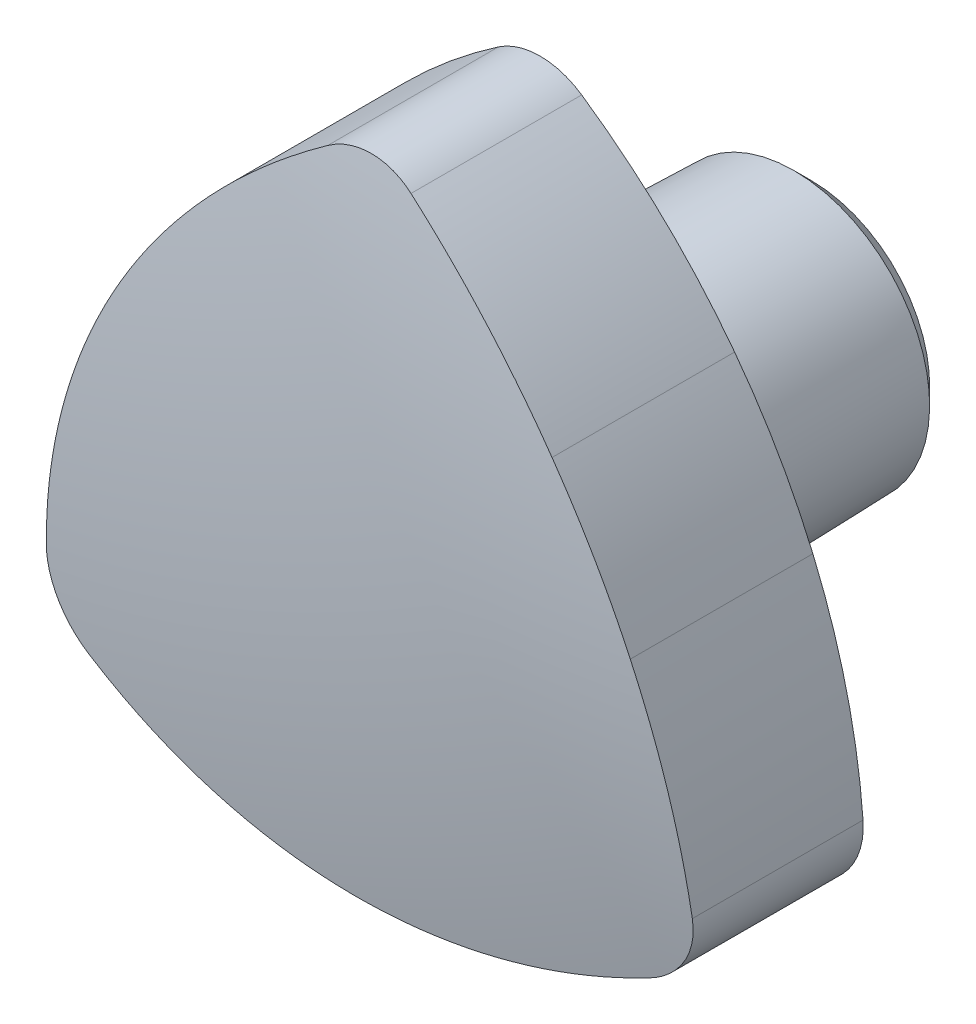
ISO-10303-21;
HEADER;
FILE_DESCRIPTION(('STEP AP214'),'2;1');
FILE_NAME('part.step','',(''),(''),'','','');
FILE_SCHEMA(('AUTOMOTIVE_DESIGN { 1 0 10303 214 1 1 1 1 }'));
ENDSEC;
DATA;
#1=APPLICATION_CONTEXT('core data for automotive mechanical design processes');
#2=APPLICATION_PROTOCOL_DEFINITION('international standard','automotive_design',2000,#1);
#3=PRODUCT_CONTEXT('',#1,'mechanical');
#4=PRODUCT('Part','Part','',(#3));
#5=PRODUCT_RELATED_PRODUCT_CATEGORY('part','',(#4));
#6=PRODUCT_DEFINITION_FORMATION('','',#4);
#7=PRODUCT_DEFINITION_CONTEXT('part definition',#1,'design');
#8=PRODUCT_DEFINITION('design','',#6,#7);
#9=PRODUCT_DEFINITION_SHAPE('','',#8);
#10=(LENGTH_UNIT() NAMED_UNIT(*) SI_UNIT(.MILLI.,.METRE.));
#11=(NAMED_UNIT(*) PLANE_ANGLE_UNIT() SI_UNIT($,.RADIAN.));
#12=(NAMED_UNIT(*) SI_UNIT($,.STERADIAN.) SOLID_ANGLE_UNIT());
#13=UNCERTAINTY_MEASURE_WITH_UNIT(LENGTH_MEASURE(1.E-05),#10,'distance_accuracy_value','');
#14=(GEOMETRIC_REPRESENTATION_CONTEXT(3) GLOBAL_UNCERTAINTY_ASSIGNED_CONTEXT((#13)) GLOBAL_UNIT_ASSIGNED_CONTEXT((#10,
#11,#12)) REPRESENTATION_CONTEXT('',''));
#15=CARTESIAN_POINT('',(0.,0.,0.));
#16=DIRECTION('',(0.,0.,1.));
#17=DIRECTION('',(1.,0.,0.));
#18=AXIS2_PLACEMENT_3D('',#15,#16,#17);
#19=CARTESIAN_POINT('',(0.,0.,10.0000000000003));
#20=DIRECTION('',(0.,0.,-1.));
#21=DIRECTION('',(0.,1.,0.));
#22=AXIS2_PLACEMENT_3D('',#19,#20,#21);
#23=PLANE('',#22);
#24=CARTESIAN_POINT('',(0.,0.,10.0000000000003));
#25=DIRECTION('',(0.,0.,-1.));
#26=DIRECTION('',(0.,1.,0.));
#27=AXIS2_PLACEMENT_3D('',#24,#25,#26);
#28=CIRCLE('',#27,2.49999999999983);
#29=CARTESIAN_POINT('',(0.,2.49999999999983,10.0000000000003));
#30=VERTEX_POINT('',#29);
#31=EDGE_CURVE('E110',#30,#30,#28,.T.);
#32=ORIENTED_EDGE('',*,*,#31,.T.);
#33=EDGE_LOOP('',(#32));
#34=FACE_BOUND('',#33,.T.);
#35=ADVANCED_FACE('F14',(#34),#23,.T.);
#36=CARTESIAN_POINT('',(0.,0.,-5.));
#37=DIRECTION('',(0.,0.,-1.));
#38=DIRECTION('',(0.,1.,0.));
#39=AXIS2_PLACEMENT_3D('',#36,#37,#38);
#40=CYLINDRICAL_SURFACE('',#39,2.49999999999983);
#41=CARTESIAN_POINT('',(0.,0.,0.));
#42=DIRECTION('',(0.,0.,-1.));
#43=DIRECTION('',(0.,1.,0.));
#44=AXIS2_PLACEMENT_3D('',#41,#42,#43);
#45=CIRCLE('',#44,2.49999999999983);
#46=CARTESIAN_POINT('',(0.,2.49999999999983,0.));
#47=VERTEX_POINT('',#46);
#48=EDGE_CURVE('E258',#47,#47,#45,.T.);
#49=ORIENTED_EDGE('',*,*,#48,.T.);
#50=EDGE_LOOP('',(#49));
#51=FACE_BOUND('',#50,.T.);
#52=ORIENTED_EDGE('',*,*,#31,.F.);
#53=EDGE_LOOP('',(#52));
#54=FACE_BOUND('',#53,.T.);
#55=ADVANCED_FACE('F247',(#51,#54),#40,.F.);
#56=CARTESIAN_POINT('',(5.22983245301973,0.,0.));
#57=DIRECTION('',(0.,0.,-1.));
#58=DIRECTION('',(0.,1.,0.));
#59=AXIS2_PLACEMENT_3D('',#56,#57,#58);
#60=PLANE('',#59);
#61=CARTESIAN_POINT('',(0.,0.,0.));
#62=DIRECTION('',(0.,0.,-1.));
#63=DIRECTION('',(0.,1.,0.));
#64=AXIS2_PLACEMENT_3D('',#61,#62,#63);
#65=CIRCLE('',#64,5.22983245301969);
#66=CARTESIAN_POINT('',(0.,5.22983245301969,0.));
#67=VERTEX_POINT('',#66);
#68=EDGE_CURVE('E260',#67,#67,#65,.T.);
#69=ORIENTED_EDGE('',*,*,#68,.T.);
#70=EDGE_LOOP('',(#69));
#71=FACE_BOUND('',#70,.T.);
#72=ORIENTED_EDGE('',*,*,#48,.F.);
#73=EDGE_LOOP('',(#72));
#74=FACE_BOUND('',#73,.T.);
#75=ADVANCED_FACE('F253',(#71,#74),#60,.T.);
#76=CARTESIAN_POINT('',(0.,0.,0.));
#77=DIRECTION('',(0.,0.,1.));
#78=DIRECTION('',(0.,-1.,0.));
#79=AXIS2_PLACEMENT_3D('',#76,#77,#78);
#80=CONICAL_SURFACE('',#79,5.22983245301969,0.785398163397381);
#81=CARTESIAN_POINT('',(0.,0.,0.770167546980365));
#82=DIRECTION('',(0.,0.,-1.));
#83=DIRECTION('',(0.,1.,0.));
#84=AXIS2_PLACEMENT_3D('',#81,#82,#83);
#85=CIRCLE('',#84,6.);
#86=CARTESIAN_POINT('',(0.,6.,0.770167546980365));
#87=VERTEX_POINT('',#86);
#88=EDGE_CURVE('E265',#87,#87,#85,.T.);
#89=ORIENTED_EDGE('',*,*,#88,.T.);
#90=EDGE_LOOP('',(#89));
#91=FACE_BOUND('',#90,.T.);
#92=ORIENTED_EDGE('',*,*,#68,.F.);
#93=EDGE_LOOP('',(#92));
#94=FACE_BOUND('',#93,.T.);
#95=ADVANCED_FACE('F436',(#91,#94),#80,.T.);
#96=CARTESIAN_POINT('',(0.,0.,0.770167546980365));
#97=DIRECTION('',(0.,0.,1.));
#98=DIRECTION('',(0.,-1.,0.));
#99=AXIS2_PLACEMENT_3D('',#96,#97,#98);
#100=CONICAL_SURFACE('',#99,6.,0.0261799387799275);
#101=CARTESIAN_POINT('',(0.,0.,9.62055355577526));
#102=DIRECTION('',(0.,0.,-1.));
#103=DIRECTION('',(0.,1.,0.));
#104=AXIS2_PLACEMENT_3D('',#101,#102,#103);
#105=CIRCLE('',#104,6.2317555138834);
#106=CARTESIAN_POINT('',(0.,6.2317555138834,9.62055355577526));
#107=VERTEX_POINT('',#106);
#108=EDGE_CURVE('E268',#107,#107,#105,.T.);
#109=ORIENTED_EDGE('',*,*,#108,.T.);
#110=EDGE_LOOP('',(#109));
#111=FACE_BOUND('',#110,.T.);
#112=ORIENTED_EDGE('',*,*,#88,.F.);
#113=EDGE_LOOP('',(#112));
#114=FACE_BOUND('',#113,.T.);
#115=ADVANCED_FACE('F426',(#111,#114),#100,.T.);
#116=CARTESIAN_POINT('',(0.,0.,9.56819965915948));
#117=DIRECTION('',(0.,0.,-1.));
#118=DIRECTION('',(0.,1.,0.));
#119=AXIS2_PLACEMENT_3D('',#116,#117,#118);
#120=TOROIDAL_SURFACE('',#119,8.23107016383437,1.99999999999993);
#121=CARTESIAN_POINT('',(0.,0.,11.551089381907));
#122=DIRECTION('',(0.,0.,-1.));
#123=DIRECTION('',(0.,1.,0.));
#124=AXIS2_PLACEMENT_3D('',#121,#122,#123);
#125=CIRCLE('',#124,7.97001777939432);
#126=CARTESIAN_POINT('',(0.,7.97001777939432,11.551089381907));
#127=VERTEX_POINT('',#126);
#128=EDGE_CURVE('E271',#127,#127,#125,.T.);
#129=ORIENTED_EDGE('',*,*,#128,.T.);
#130=EDGE_LOOP('',(#129));
#131=FACE_BOUND('',#130,.T.);
#132=ORIENTED_EDGE('',*,*,#108,.F.);
#133=EDGE_LOOP('',(#132));
#134=FACE_BOUND('',#133,.T.);
#135=ADVANCED_FACE('F415',(#131,#134),#120,.F.);
#136=CARTESIAN_POINT('',(0.,0.,11.551089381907));
#137=DIRECTION('',(0.,0.,1.));
#138=DIRECTION('',(0.,-1.,0.));
#139=AXIS2_PLACEMENT_3D('',#136,#137,#138);
#140=CONICAL_SURFACE('',#139,7.97001777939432,1.43989663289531);
#141=CARTESIAN_POINT('',(0.,0.,12.));
#142=DIRECTION('',(0.,0.,-1.));
#143=DIRECTION('',(0.,1.,0.));
#144=AXIS2_PLACEMENT_3D('',#141,#142,#143);
#145=CIRCLE('',#144,11.3798324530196);
#146=CARTESIAN_POINT('',(0.,11.3798324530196,12.));
#147=VERTEX_POINT('',#146);
#148=EDGE_CURVE('E274',#147,#147,#145,.T.);
#149=ORIENTED_EDGE('',*,*,#148,.T.);
#150=EDGE_LOOP('',(#149));
#151=FACE_BOUND('',#150,.T.);
#152=ORIENTED_EDGE('',*,*,#128,.F.);
#153=EDGE_LOOP('',(#152));
#154=FACE_BOUND('',#153,.T.);
#155=ADVANCED_FACE('F244',(#151,#154),#140,.T.);
#156=CARTESIAN_POINT('',(11.3798324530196,0.,12.));
#157=DIRECTION('',(0.,0.,-1.));
#158=DIRECTION('',(0.,1.,0.));
#159=AXIS2_PLACEMENT_3D('',#156,#157,#158);
#160=PLANE('',#159);
#161=CARTESIAN_POINT('',(14.3205353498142,-8.26796493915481,12.));
#162=DIRECTION('',(0.,0.,-1.));
#163=DIRECTION('',(0.,1.,0.));
#164=AXIS2_PLACEMENT_3D('',#161,#162,#163);
#165=CIRCLE('',#164,28.6793827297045);
#166=CARTESIAN_POINT('',(-8.60473342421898,8.96395443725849,12.));
#167=VERTEX_POINT('',#166);
#168=CARTESIAN_POINT('',(-12.0653789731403,2.96994051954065,12.));
#169=VERTEX_POINT('',#168);
#170=EDGE_CURVE('E277',#167,#169,#165,.F.);
#171=ORIENTED_EDGE('',*,*,#170,.F.);
#172=CARTESIAN_POINT('',(14.3738212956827,-8.29872959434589,12.));
#173=DIRECTION('',(0.,0.,-1.));
#174=DIRECTION('',(0.,1.,0.));
#175=AXIS2_PLACEMENT_3D('',#172,#173,#174);
#176=CIRCLE('',#175,28.7404634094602);
#177=CARTESIAN_POINT('',(-1.84028850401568,15.4313542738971,12.));
#178=VERTEX_POINT('',#177);
#179=EDGE_CURVE('E298',#178,#167,#176,.F.);
#180=ORIENTED_EDGE('',*,*,#179,.F.);
#181=CARTESIAN_POINT('',(0.,12.7379490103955,12.));
#182=DIRECTION('',(0.,0.,-1.));
#183=DIRECTION('',(0.,1.,0.));
#184=AXIS2_PLACEMENT_3D('',#181,#182,#183);
#185=CIRCLE('',#184,3.2620689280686);
#186=CARTESIAN_POINT('',(1.84028850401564,15.4313542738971,12.));
#187=VERTEX_POINT('',#186);
#188=EDGE_CURVE('E117',#187,#178,#185,.F.);
#189=ORIENTED_EDGE('',*,*,#188,.F.);
#190=CARTESIAN_POINT('',(-14.3738212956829,-8.29872959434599,12.));
#191=DIRECTION('',(0.,0.,-1.));
#192=DIRECTION('',(0.,1.,0.));
#193=AXIS2_PLACEMENT_3D('',#190,#191,#192);
#194=CIRCLE('',#193,28.7404634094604);
#195=CARTESIAN_POINT('',(8.60473342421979,8.96395443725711,12.));
#196=VERTEX_POINT('',#195);
#197=EDGE_CURVE('E295',#196,#187,#194,.F.);
#198=ORIENTED_EDGE('',*,*,#197,.F.);
#199=CARTESIAN_POINT('',(-14.3205353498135,-8.2679649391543,12.));
#200=DIRECTION('',(0.,0.,-1.));
#201=DIRECTION('',(0.,1.,0.));
#202=AXIS2_PLACEMENT_3D('',#199,#200,#201);
#203=CIRCLE('',#202,28.6793827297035);
#204=CARTESIAN_POINT('',(12.065378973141,2.9699405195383,12.));
#205=VERTEX_POINT('',#204);
#206=EDGE_CURVE('E293',#205,#196,#203,.F.);
#207=ORIENTED_EDGE('',*,*,#206,.F.);
#208=CARTESIAN_POINT('',(-14.3738212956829,-8.29872959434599,12.));
#209=DIRECTION('',(0.,0.,-1.));
#210=DIRECTION('',(0.,1.,0.));
#211=AXIS2_PLACEMENT_3D('',#208,#209,#210);
#212=CIRCLE('',#211,28.7404634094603);
#213=CARTESIAN_POINT('',(14.2840890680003,-6.12194054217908,12.));
#214=VERTEX_POINT('',#213);
#215=EDGE_CURVE('E291',#214,#205,#212,.F.);
#216=ORIENTED_EDGE('',*,*,#215,.F.);
#217=CARTESIAN_POINT('',(11.0313874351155,-6.3689745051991,12.));
#218=DIRECTION('',(0.,0.,-1.));
#219=DIRECTION('',(0.,1.,0.));
#220=AXIS2_PLACEMENT_3D('',#217,#218,#219);
#221=CIRCLE('',#220,3.26206892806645);
#222=CARTESIAN_POINT('',(12.4438005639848,-9.30941373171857,12.));
#223=VERTEX_POINT('',#222);
#224=EDGE_CURVE('E289',#223,#214,#221,.F.);
#225=ORIENTED_EDGE('',*,*,#224,.F.);
#226=CARTESIAN_POINT('',(0.,16.597459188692,12.));
#227=DIRECTION('',(0.,0.,-1.));
#228=DIRECTION('',(0.,1.,0.));
#229=AXIS2_PLACEMENT_3D('',#226,#227,#228);
#230=CIRCLE('',#229,28.7404634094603);
#231=CARTESIAN_POINT('',(3.46064554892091,-11.9338949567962,12.));
#232=VERTEX_POINT('',#231);
#233=EDGE_CURVE('E287',#232,#223,#230,.F.);
#234=ORIENTED_EDGE('',*,*,#233,.F.);
#235=CARTESIAN_POINT('',(0.,16.5359298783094,12.));
#236=DIRECTION('',(0.,0.,-1.));
#237=DIRECTION('',(0.,1.,0.));
#238=AXIS2_PLACEMENT_3D('',#235,#236,#237);
#239=CIRCLE('',#238,28.6793827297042);
#240=CARTESIAN_POINT('',(-3.46064554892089,-11.9338949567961,12.));
#241=VERTEX_POINT('',#240);
#242=EDGE_CURVE('E285',#241,#232,#239,.F.);
#243=ORIENTED_EDGE('',*,*,#242,.F.);
#244=CARTESIAN_POINT('',(0.,16.597459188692,12.));
#245=DIRECTION('',(0.,0.,-1.));
#246=DIRECTION('',(0.,1.,0.));
#247=AXIS2_PLACEMENT_3D('',#244,#245,#246);
#248=CIRCLE('',#247,28.7404634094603);
#249=CARTESIAN_POINT('',(-12.4438005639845,-9.30941373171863,12.));
#250=VERTEX_POINT('',#249);
#251=EDGE_CURVE('E283',#250,#241,#248,.F.);
#252=ORIENTED_EDGE('',*,*,#251,.F.);
#253=CARTESIAN_POINT('',(-11.0313874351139,-6.3689745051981,12.));
#254=DIRECTION('',(0.,0.,-1.));
#255=DIRECTION('',(0.,1.,0.));
#256=AXIS2_PLACEMENT_3D('',#253,#254,#255);
#257=CIRCLE('',#256,3.26206892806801);
#258=CARTESIAN_POINT('',(-14.2840890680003,-6.12194054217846,12.));
#259=VERTEX_POINT('',#258);
#260=EDGE_CURVE('E281',#259,#250,#257,.F.);
#261=ORIENTED_EDGE('',*,*,#260,.F.);
#262=CARTESIAN_POINT('',(14.3738212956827,-8.29872959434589,12.));
#263=DIRECTION('',(0.,0.,-1.));
#264=DIRECTION('',(0.,1.,0.));
#265=AXIS2_PLACEMENT_3D('',#262,#263,#264);
#266=CIRCLE('',#265,28.7404634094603);
#267=EDGE_CURVE('E279',#169,#259,#266,.F.);
#268=ORIENTED_EDGE('',*,*,#267,.F.);
#269=EDGE_LOOP('',(#171,#180,#189,#198,#207,#216,#225,#234,#243,#252,#261,#268));
#270=FACE_BOUND('',#269,.T.);
#271=ORIENTED_EDGE('',*,*,#148,.F.);
#272=EDGE_LOOP('',(#271));
#273=FACE_BOUND('',#272,.T.);
#274=ADVANCED_FACE('F237',(#270,#273),#160,.T.);
#275=CARTESIAN_POINT('',(14.3205353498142,-8.26796493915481,21.));
#276=DIRECTION('',(0.,0.,-1.));
#277=DIRECTION('',(0.,1.,0.));
#278=AXIS2_PLACEMENT_3D('',#275,#276,#277);
#279=CYLINDRICAL_SURFACE('',#278,28.6793827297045);
#280=ORIENTED_EDGE('',*,*,#170,.T.);
#281=DIRECTION('',(0.,0.,-1.));
#282=VECTOR('',#281,1.);
#283=CARTESIAN_POINT('',(-12.0653789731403,2.96994051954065,21.));
#284=LINE('',#283,#282);
#285=CARTESIAN_POINT('',(-12.0653789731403,2.96994051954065,20.0759055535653));
#286=VERTEX_POINT('',#285);
#287=EDGE_CURVE('E300',#286,#169,#284,.T.);
#288=ORIENTED_EDGE('',*,*,#287,.F.);
#289=CARTESIAN_POINT('',(-12.0654641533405,2.96974051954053,20.0759003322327));
#290=CARTESIAN_POINT('',(-11.8385300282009,3.50264237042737,20.0898168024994));
#291=CARTESIAN_POINT('',(-11.595374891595,4.02872451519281,20.1002566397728));
#292=CARTESIAN_POINT('',(-11.0786108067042,5.06331800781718,20.1141384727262));
#293=CARTESIAN_POINT('',(-10.8051206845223,5.57188835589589,20.117606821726));
#294=CARTESIAN_POINT('',(-10.2279402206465,6.57159292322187,20.1176066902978));
#295=CARTESIAN_POINT('',(-9.9242498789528,7.06272714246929,20.1141382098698));
#296=CARTESIAN_POINT('',(-9.28664657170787,8.02755398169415,20.1002561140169));
#297=CARTESIAN_POINT('',(-8.95262309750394,8.50117319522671,20.0898161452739));
#298=CARTESIAN_POINT('',(-8.60458309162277,8.96415443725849,20.0758995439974));
#299=B_SPLINE_CURVE_WITH_KNOTS('',3,(#289,#290,#291,#292,#293,#294,#295,#296,#297,#298),
.UNSPECIFIED.,.F.,.F.,(4,2,2,2,4),(0.,1.73784960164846,3.46911741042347,5.20038521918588,
6.93823482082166),.UNSPECIFIED.);
#300=CARTESIAN_POINT('',(-8.60473342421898,8.96395443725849,20.0759055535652));
#301=VERTEX_POINT('',#300);
#302=EDGE_CURVE('E9',#286,#301,#299,.T.);
#303=ORIENTED_EDGE('',*,*,#302,.T.);
#304=DIRECTION('',(0.,0.,-1.));
#305=VECTOR('',#304,1.);
#306=CARTESIAN_POINT('',(-8.60473342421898,8.96395443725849,21.));
#307=LINE('',#306,#305);
#308=EDGE_CURVE('E39',#301,#167,#307,.T.);
#309=ORIENTED_EDGE('',*,*,#308,.T.);
#310=EDGE_LOOP('',(#280,#288,#303,#309));
#311=FACE_BOUND('',#310,.T.);
#312=ADVANCED_FACE('F233',(#311),#279,.T.);
#313=CARTESIAN_POINT('',(14.3738212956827,-8.29872959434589,21.));
#314=DIRECTION('',(0.,0.,-1.));
#315=DIRECTION('',(0.,1.,0.));
#316=AXIS2_PLACEMENT_3D('',#313,#314,#315);
#317=CYLINDRICAL_SURFACE('',#316,28.7404634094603);
#318=ORIENTED_EDGE('',*,*,#267,.T.);
#319=DIRECTION('',(0.,0.,-1.));
#320=VECTOR('',#319,1.);
#321=CARTESIAN_POINT('',(-14.2840890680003,-6.12194054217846,21.));
#322=LINE('',#321,#320);
#323=CARTESIAN_POINT('',(-14.2840890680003,-6.12194054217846,19.5499039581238));
#324=VERTEX_POINT('',#323);
#325=EDGE_CURVE('E303',#324,#259,#322,.T.);
#326=ORIENTED_EDGE('',*,*,#325,.F.);
#327=CARTESIAN_POINT('',(-14.2841042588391,-6.12214054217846,19.5498864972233));
#328=CARTESIAN_POINT('',(-14.2543970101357,-5.73099095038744,19.5840359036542));
#329=CARTESIAN_POINT('',(-14.2166724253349,-5.3403632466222,19.6167158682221));
#330=CARTESIAN_POINT('',(-14.1252271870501,-4.56074477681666,19.6790940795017));
#331=CARTESIAN_POINT('',(-14.0715064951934,-4.17175401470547,19.7087923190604));
#332=CARTESIAN_POINT('',(-13.8872817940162,-3.01362009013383,19.7929509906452));
#333=CARTESIAN_POINT('',(-13.7332919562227,-2.24776193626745,19.8429596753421));
#334=CARTESIAN_POINT('',(-13.363252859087,-0.730457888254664,19.9307036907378));
#335=CARTESIAN_POINT('',(-13.1472030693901,0.0209878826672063,19.9684389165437));
#336=CARTESIAN_POINT('',(-12.7768317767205,1.1358443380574,20.0157670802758));
#337=CARTESIAN_POINT('',(-12.645111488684,1.50669637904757,20.030031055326));
#338=CARTESIAN_POINT('',(-12.3665170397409,2.24277827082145,20.0553682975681));
#339=CARTESIAN_POINT('',(-12.2196427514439,2.6080080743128,20.0664415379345));
#340=CARTESIAN_POINT('',(-12.0652937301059,2.97014051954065,20.0759107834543));
#341=B_SPLINE_CURVE_WITH_KNOTS('',3,(#327,#328,#329,#330,#331,#332,#333,#334,#335,#336,#337,
#338,#339,#340),.UNSPECIFIED.,.F.,.F.,(4,2,2,2,2,2,4),(0.,1.1811119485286,2.36222673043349,
4.70773754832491,7.05326841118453,8.23439072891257,9.41552297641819),.UNSPECIFIED.);
#342=EDGE_CURVE('E27',#324,#286,#341,.T.);
#343=ORIENTED_EDGE('',*,*,#342,.T.);
#344=ORIENTED_EDGE('',*,*,#287,.T.);
#345=EDGE_LOOP('',(#318,#326,#343,#344));
#346=FACE_BOUND('',#345,.T.);
#347=ADVANCED_FACE('F229',(#346),#317,.T.);
#348=CARTESIAN_POINT('',(-11.0313874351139,-6.3689745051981,21.));
#349=DIRECTION('',(0.,0.,-1.));
#350=DIRECTION('',(0.,1.,0.));
#351=AXIS2_PLACEMENT_3D('',#348,#349,#350);
#352=CYLINDRICAL_SURFACE('',#351,3.26206892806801);
#353=ORIENTED_EDGE('',*,*,#260,.T.);
#354=DIRECTION('',(0.,0.,-1.));
#355=VECTOR('',#354,1.);
#356=CARTESIAN_POINT('',(-12.4438005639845,-9.30941373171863,21.));
#357=LINE('',#356,#355);
#358=CARTESIAN_POINT('',(-12.4438005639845,-9.30941373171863,19.5499039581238));
#359=VERTEX_POINT('',#358);
#360=EDGE_CURVE('E306',#359,#250,#357,.T.);
#361=ORIENTED_EDGE('',*,*,#360,.F.);
#362=CARTESIAN_POINT('',(-12.4436005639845,-9.30950979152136,19.5499232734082));
#363=CARTESIAN_POINT('',(-12.5253935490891,-9.27023800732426,19.5420229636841));
#364=CARTESIAN_POINT('',(-12.6055755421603,-9.22752072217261,19.534602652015));
#365=CARTESIAN_POINT('',(-12.7621656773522,-9.13551248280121,19.5207720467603));
#366=CARTESIAN_POINT('',(-12.8385738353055,-9.08622155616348,19.514361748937));
#367=CARTESIAN_POINT('',(-12.9870296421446,-8.98140808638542,19.5026039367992));
#368=CARTESIAN_POINT('',(-13.0590793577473,-8.92588853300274,19.4972559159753));
#369=CARTESIAN_POINT('',(-13.1983186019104,-8.80901073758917,19.487659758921));
#370=CARTESIAN_POINT('',(-13.265508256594,-8.74765264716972,19.483411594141));
#371=CARTESIAN_POINT('',(-13.45912485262,-8.55534316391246,19.4723659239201));
#372=CARTESIAN_POINT('',(-13.5776402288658,-8.41612771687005,19.4672640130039));
#373=CARTESIAN_POINT('',(-13.7897410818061,-8.11991624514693,19.4617682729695));
#374=CARTESIAN_POINT('',(-13.8833317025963,-7.96292389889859,19.4613734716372));
#375=CARTESIAN_POINT('',(-14.042715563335,-7.63621579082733,19.4652851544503));
#376=CARTESIAN_POINT('',(-14.1086148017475,-7.46655152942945,19.4695734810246));
#377=CARTESIAN_POINT('',(-14.2112723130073,-7.11880679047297,19.4826963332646));
#378=CARTESIAN_POINT('',(-14.2480431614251,-6.94072998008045,19.491528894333));
#379=CARTESIAN_POINT('',(-14.2826679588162,-6.65489000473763,19.5089653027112));
#380=CARTESIAN_POINT('',(-14.2902846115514,-6.5481298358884,19.516187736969));
#381=CARTESIAN_POINT('',(-14.2950194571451,-6.3346903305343,19.5320274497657));
#382=CARTESIAN_POINT('',(-14.2921581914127,-6.22801124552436,19.5406419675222));
#383=CARTESIAN_POINT('',(-14.2840738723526,-6.12174054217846,19.5499214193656));
#384=B_SPLINE_CURVE_WITH_KNOTS('',3,(#362,#363,#364,#365,#366,#367,#368,#369,#370,#371,#372,
#373,#374,#375,#376,#377,#378,#379,#380,#381,#382,#383),.UNSPECIFIED.,.F.,.F.,(4,2,2,2,2,2,2,2,
2,2,4),(0.,0.273141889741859,0.546282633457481,0.819292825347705,1.09229592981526,
1.63815382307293,2.18389897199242,2.72753562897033,3.27093745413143,3.59228706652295,
3.91300702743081),.UNSPECIFIED.);
#385=EDGE_CURVE('E216',#359,#324,#384,.T.);
#386=ORIENTED_EDGE('',*,*,#385,.T.);
#387=ORIENTED_EDGE('',*,*,#325,.T.);
#388=EDGE_LOOP('',(#353,#361,#386,#387));
#389=FACE_BOUND('',#388,.T.);
#390=ADVANCED_FACE('F226',(#389),#352,.T.);
#391=CARTESIAN_POINT('',(0.,16.597459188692,21.));
#392=DIRECTION('',(0.,0.,-1.));
#393=DIRECTION('',(0.,1.,0.));
#394=AXIS2_PLACEMENT_3D('',#391,#392,#393);
#395=CYLINDRICAL_SURFACE('',#394,28.7404634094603);
#396=ORIENTED_EDGE('',*,*,#251,.T.);
#397=DIRECTION('',(0.,0.,-1.));
#398=VECTOR('',#397,1.);
#399=CARTESIAN_POINT('',(-3.46064554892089,-11.9338949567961,21.));
#400=LINE('',#399,#398);
#401=CARTESIAN_POINT('',(-3.46064554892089,-11.9338949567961,20.0759055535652));
#402=VERTEX_POINT('',#401);
#403=EDGE_CURVE('E309',#402,#241,#400,.T.);
#404=ORIENTED_EDGE('',*,*,#403,.F.);
#405=CARTESIAN_POINT('',(-3.46044554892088,-11.9339192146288,20.0759103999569));
#406=CARTESIAN_POINT('',(-3.85123615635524,-11.8865229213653,20.0664411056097));
#407=CARTESIAN_POINT('',(-4.2409717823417,-11.8311046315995,20.0553678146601));
#408=CARTESIAN_POINT('',(-5.01773499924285,-11.7043330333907,20.0300304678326));
#409=CARTESIAN_POINT('',(-5.40476261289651,-11.6329798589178,20.0157664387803));
#410=CARTESIAN_POINT('',(-6.55544278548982,-11.3963017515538,19.9684381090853));
#411=CARTESIAN_POINT('',(-7.31423912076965,-11.2076828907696,19.9307027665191));
#412=CARTESIAN_POINT('',(-8.81328308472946,-10.7694929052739,19.8429585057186));
#413=CARTESIAN_POINT('',(-9.55353087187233,-10.5199223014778,19.792949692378));
#414=CARTESIAN_POINT('',(-10.6486169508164,-10.1003976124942,19.7087908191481));
#415=CARTESIAN_POINT('',(-11.0123532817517,-9.95242537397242,19.679092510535));
#416=CARTESIAN_POINT('',(-11.733245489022,-9.64180934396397,19.6167141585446));
#417=CARTESIAN_POINT('',(-12.0904013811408,-9.47916558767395,19.5840341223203));
#418=CARTESIAN_POINT('',(-12.4440005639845,-9.30931766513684,19.5498846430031));
#419=B_SPLINE_CURVE_WITH_KNOTS('',3,(#405,#406,#407,#408,#409,#410,#411,#412,#413,#414,#415,
#416,#417,#418),.UNSPECIFIED.,.F.,.F.,(4,2,2,2,2,2,4),(0.,1.18113293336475,2.36225593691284,
4.70778814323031,7.05330030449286,8.23441577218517,9.41552840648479),.UNSPECIFIED.);
#420=EDGE_CURVE('E210',#402,#359,#419,.T.);
#421=ORIENTED_EDGE('',*,*,#420,.T.);
#422=ORIENTED_EDGE('',*,*,#360,.T.);
#423=EDGE_LOOP('',(#396,#404,#421,#422));
#424=FACE_BOUND('',#423,.T.);
#425=ADVANCED_FACE('F200',(#424),#395,.T.);
#426=CARTESIAN_POINT('',(0.,16.5359298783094,21.));
#427=DIRECTION('',(0.,0.,-1.));
#428=DIRECTION('',(0.,1.,0.));
#429=AXIS2_PLACEMENT_3D('',#426,#427,#428);
#430=CYLINDRICAL_SURFACE('',#429,28.6793827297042);
#431=ORIENTED_EDGE('',*,*,#242,.T.);
#432=DIRECTION('',(0.,0.,-1.));
#433=VECTOR('',#432,1.);
#434=CARTESIAN_POINT('',(3.46064554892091,-11.9338949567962,21.));
#435=LINE('',#434,#433);
#436=CARTESIAN_POINT('',(3.46064554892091,-11.9338949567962,20.0759055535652));
#437=VERTEX_POINT('',#436);
#438=EDGE_CURVE('E312',#437,#232,#435,.T.);
#439=ORIENTED_EDGE('',*,*,#438,.F.);
#440=CARTESIAN_POINT('',(3.46084554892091,-11.9338706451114,20.0759007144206));
#441=CARTESIAN_POINT('',(2.88587728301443,-12.0037898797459,20.0898169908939));
#442=CARTESIAN_POINT('',(2.30870460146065,-12.056251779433,20.1002566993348));
#443=CARTESIAN_POINT('',(1.15434906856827,-12.1260170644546,20.1141384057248));
#444=CARTESIAN_POINT('',(0.577174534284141,-12.1434528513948,20.1176067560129));
#445=CARTESIAN_POINT('',(-0.577174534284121,-12.1434528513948,20.1176067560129));
#446=CARTESIAN_POINT('',(-1.15434906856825,-12.1260170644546,20.1141384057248));
#447=CARTESIAN_POINT('',(-2.30870460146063,-12.056251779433,20.1002566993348));
#448=CARTESIAN_POINT('',(-2.88587728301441,-12.0037898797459,20.0898169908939));
#449=CARTESIAN_POINT('',(-3.46084554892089,-11.9338706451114,20.0759007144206));
#450=B_SPLINE_CURVE_WITH_KNOTS('',3,(#440,#441,#442,#443,#444,#445,#446,#447,#448,#449),
.UNSPECIFIED.,.F.,.F.,(4,2,2,2,4),(0.,1.73783335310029,3.4690850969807,5.2003368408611,
6.9381701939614),.UNSPECIFIED.);
#451=EDGE_CURVE('E204',#437,#402,#450,.T.);
#452=ORIENTED_EDGE('',*,*,#451,.T.);
#453=ORIENTED_EDGE('',*,*,#403,.T.);
#454=EDGE_LOOP('',(#431,#439,#452,#453));
#455=FACE_BOUND('',#454,.T.);
#456=ADVANCED_FACE('F195',(#455),#430,.T.);
#457=CARTESIAN_POINT('',(0.,16.597459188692,21.));
#458=DIRECTION('',(0.,0.,-1.));
#459=DIRECTION('',(0.,1.,0.));
#460=AXIS2_PLACEMENT_3D('',#457,#458,#459);
#461=CYLINDRICAL_SURFACE('',#460,28.7404634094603);
#462=ORIENTED_EDGE('',*,*,#233,.T.);
#463=DIRECTION('',(0.,0.,-1.));
#464=VECTOR('',#463,1.);
#465=CARTESIAN_POINT('',(12.4438005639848,-9.30941373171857,21.));
#466=LINE('',#465,#464);
#467=CARTESIAN_POINT('',(12.4438005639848,-9.30941373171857,19.5499039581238));
#468=VERTEX_POINT('',#467);
#469=EDGE_CURVE('E315',#468,#223,#466,.T.);
#470=ORIENTED_EDGE('',*,*,#469,.F.);
#471=CARTESIAN_POINT('',(12.4440005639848,-9.30931766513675,19.5498846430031));
#472=CARTESIAN_POINT('',(12.0904013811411,-9.47916558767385,19.5840341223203));
#473=CARTESIAN_POINT('',(11.7332454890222,-9.64180934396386,19.6167141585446));
#474=CARTESIAN_POINT('',(11.0123532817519,-9.95242537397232,19.679092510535));
#475=CARTESIAN_POINT('',(10.6486169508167,-10.1003976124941,19.7087908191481));
#476=CARTESIAN_POINT('',(9.55353087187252,-10.5199223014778,19.792949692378));
#477=CARTESIAN_POINT('',(8.81328308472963,-10.7694929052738,19.8429585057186));
#478=CARTESIAN_POINT('',(7.31423912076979,-11.2076828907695,19.9307027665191));
#479=CARTESIAN_POINT('',(6.55544278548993,-11.3963017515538,19.9684381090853));
#480=CARTESIAN_POINT('',(5.40476261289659,-11.6329798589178,20.0157664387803));
#481=CARTESIAN_POINT('',(5.01773499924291,-11.7043330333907,20.0300304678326));
#482=CARTESIAN_POINT('',(4.24097178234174,-11.8311046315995,20.0553678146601));
#483=CARTESIAN_POINT('',(3.85123615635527,-11.8865229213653,20.0664411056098));
#484=CARTESIAN_POINT('',(3.4604455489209,-11.9339192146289,20.0759103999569));
#485=B_SPLINE_CURVE_WITH_KNOTS('',3,(#471,#472,#473,#474,#475,#476,#477,#478,#479,#480,#481,
#482,#483,#484),.UNSPECIFIED.,.F.,.F.,(4,2,2,2,2,2,4),(0.,1.18111263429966,2.362228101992,
4.70774026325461,7.05327246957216,8.23439547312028,9.41552840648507),.UNSPECIFIED.);
#486=EDGE_CURVE('E180',#468,#437,#485,.T.);
#487=ORIENTED_EDGE('',*,*,#486,.T.);
#488=ORIENTED_EDGE('',*,*,#438,.T.);
#489=EDGE_LOOP('',(#462,#470,#487,#488));
#490=FACE_BOUND('',#489,.T.);
#491=ADVANCED_FACE('F190',(#490),#461,.T.);
#492=CARTESIAN_POINT('',(11.0313874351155,-6.3689745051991,21.));
#493=DIRECTION('',(0.,0.,-1.));
#494=DIRECTION('',(0.,1.,0.));
#495=AXIS2_PLACEMENT_3D('',#492,#493,#494);
#496=CYLINDRICAL_SURFACE('',#495,3.26206892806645);
#497=ORIENTED_EDGE('',*,*,#224,.T.);
#498=DIRECTION('',(0.,0.,-1.));
#499=VECTOR('',#498,1.);
#500=CARTESIAN_POINT('',(14.2840890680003,-6.12194054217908,21.));
#501=LINE('',#500,#499);
#502=CARTESIAN_POINT('',(14.2840890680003,-6.12194054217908,19.5499039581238));
#503=VERTEX_POINT('',#502);
#504=EDGE_CURVE('E318',#503,#214,#501,.T.);
#505=ORIENTED_EDGE('',*,*,#504,.F.);
#506=CARTESIAN_POINT('',(14.2840738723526,-6.12174054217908,19.5499214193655));
#507=CARTESIAN_POINT('',(14.2909594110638,-6.21221127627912,19.5420211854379));
#508=CARTESIAN_POINT('',(14.2940555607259,-6.30300957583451,19.534600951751));
#509=CARTESIAN_POINT('',(14.2926679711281,-6.4846247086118,19.5207705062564));
#510=CARTESIAN_POINT('',(14.2881842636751,-6.57544154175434,19.5143602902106));
#511=CARTESIAN_POINT('',(14.2716398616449,-6.7564146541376,19.5026026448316));
#512=CARTESIAN_POINT('',(14.2595827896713,-6.8465712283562,19.4972547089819));
#513=CARTESIAN_POINT('',(14.2279821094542,-7.02559462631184,19.4876587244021));
#514=CARTESIAN_POINT('',(14.2084386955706,-7.11446148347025,19.4834106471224));
#515=CARTESIAN_POINT('',(14.1387003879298,-7.37829263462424,19.4723652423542));
#516=CARTESIAN_POINT('',(14.0773928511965,-7.55053726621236,19.4672635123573));
#517=CARTESIAN_POINT('',(13.9269144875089,-7.88232671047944,19.4617681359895));
#518=CARTESIAN_POINT('',(13.8377494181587,-8.04187413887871,19.4613735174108));
#519=CARTESIAN_POINT('',(13.6345019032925,-8.34325732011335,19.4652855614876));
#520=CARTESIAN_POINT('',(13.5205170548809,-8.48515911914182,19.4695740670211));
#521=CARTESIAN_POINT('',(13.270688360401,-8.74793386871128,19.4826972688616));
#522=CARTESIAN_POINT('',(13.1348539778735,-8.86881587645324,19.4915300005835));
#523=CARTESIAN_POINT('',(12.904620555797,-9.04172035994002,19.5089666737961));
#524=CARTESIAN_POINT('',(12.8159714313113,-9.10169611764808,19.5161892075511));
#525=CARTESIAN_POINT('',(12.6334940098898,-9.21251524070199,19.5320291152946));
#526=CARTESIAN_POINT('',(12.5396762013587,-9.26337626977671,19.5406437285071));
#527=CARTESIAN_POINT('',(12.4436005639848,-9.30950979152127,19.5499232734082));
#528=B_SPLINE_CURVE_WITH_KNOTS('',3,(#506,#507,#508,#509,#510,#511,#512,#513,#514,#515,#516,
#517,#518,#519,#520,#521,#522,#523,#524,#525,#526,#527),.UNSPECIFIED.,.F.,.F.,(4,2,2,2,2,2,2,2,
2,2,4),(0.,0.273141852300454,0.546282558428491,0.819292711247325,1.09229577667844,
1.63815359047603,2.18389866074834,2.72753528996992,3.27093708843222,3.59228688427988,
3.91300702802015),.UNSPECIFIED.);
#529=EDGE_CURVE('E174',#503,#468,#528,.T.);
#530=ORIENTED_EDGE('',*,*,#529,.T.);
#531=ORIENTED_EDGE('',*,*,#469,.T.);
#532=EDGE_LOOP('',(#497,#505,#530,#531));
#533=FACE_BOUND('',#532,.T.);
#534=ADVANCED_FACE('F187',(#533),#496,.T.);
#535=CARTESIAN_POINT('',(-14.3738212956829,-8.29872959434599,21.));
#536=DIRECTION('',(0.,0.,-1.));
#537=DIRECTION('',(0.,1.,0.));
#538=AXIS2_PLACEMENT_3D('',#535,#536,#537);
#539=CYLINDRICAL_SURFACE('',#538,28.7404634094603);
#540=ORIENTED_EDGE('',*,*,#215,.T.);
#541=DIRECTION('',(0.,0.,-1.));
#542=VECTOR('',#541,1.);
#543=CARTESIAN_POINT('',(12.065378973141,2.9699405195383,21.));
#544=LINE('',#543,#542);
#545=CARTESIAN_POINT('',(12.065378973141,2.9699405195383,20.0759055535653));
#546=VERTEX_POINT('',#545);
#547=EDGE_CURVE('E321',#546,#205,#544,.T.);
#548=ORIENTED_EDGE('',*,*,#547,.F.);
#549=CARTESIAN_POINT('',(12.0652937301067,2.9701405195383,20.0759107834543));
#550=CARTESIAN_POINT('',(12.2196427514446,2.60800807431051,20.0664415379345));
#551=CARTESIAN_POINT('',(12.3665170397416,2.24277827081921,20.0553682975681));
#552=CARTESIAN_POINT('',(12.6451114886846,1.50669637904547,20.0300310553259));
#553=CARTESIAN_POINT('',(12.776831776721,1.13584433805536,20.0157670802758));
#554=CARTESIAN_POINT('',(13.1472030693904,0.0209878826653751,19.9684389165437));
#555=CARTESIAN_POINT('',(13.3632528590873,-0.730457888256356,19.9307036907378));
#556=CARTESIAN_POINT('',(13.7332919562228,-2.24776193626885,19.8429596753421));
#557=CARTESIAN_POINT('',(13.8872817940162,-3.01362009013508,19.7929509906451));
#558=CARTESIAN_POINT('',(14.0715064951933,-4.17175401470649,19.7087923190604));
#559=CARTESIAN_POINT('',(14.1252271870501,-4.5607447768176,19.6790940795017));
#560=CARTESIAN_POINT('',(14.2166724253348,-5.34036324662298,19.616715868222));
#561=CARTESIAN_POINT('',(14.2543970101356,-5.73099095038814,19.5840359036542));
#562=CARTESIAN_POINT('',(14.2841042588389,-6.12214054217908,19.5498864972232));
#563=B_SPLINE_CURVE_WITH_KNOTS('',3,(#549,#550,#551,#552,#553,#554,#555,#556,#557,#558,#559,
#560,#561,#562),.UNSPECIFIED.,.F.,.F.,(4,2,2,2,2,2,4),(0.,1.18113224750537,2.36225456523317,
4.70778542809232,7.05329624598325,8.2344110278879,9.41552297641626),.UNSPECIFIED.);
#564=EDGE_CURVE('E168',#546,#503,#563,.T.);
#565=ORIENTED_EDGE('',*,*,#564,.T.);
#566=ORIENTED_EDGE('',*,*,#504,.T.);
#567=EDGE_LOOP('',(#540,#548,#565,#566));
#568=FACE_BOUND('',#567,.T.);
#569=ADVANCED_FACE('F159',(#568),#539,.T.);
#570=CARTESIAN_POINT('',(-14.3205353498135,-8.2679649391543,21.));
#571=DIRECTION('',(0.,0.,-1.));
#572=DIRECTION('',(0.,1.,0.));
#573=AXIS2_PLACEMENT_3D('',#570,#571,#572);
#574=CYLINDRICAL_SURFACE('',#573,28.6793827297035);
#575=ORIENTED_EDGE('',*,*,#206,.T.);
#576=DIRECTION('',(0.,0.,-1.));
#577=VECTOR('',#576,1.);
#578=CARTESIAN_POINT('',(8.60473342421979,8.96395443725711,21.));
#579=LINE('',#578,#577);
#580=CARTESIAN_POINT('',(8.60473342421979,8.96395443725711,20.0759055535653));
#581=VERTEX_POINT('',#580);
#582=EDGE_CURVE('E324',#581,#196,#579,.T.);
#583=ORIENTED_EDGE('',*,*,#582,.F.);
#584=CARTESIAN_POINT('',(8.60458309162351,8.96415443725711,20.0758995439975));
#585=CARTESIAN_POINT('',(8.95262309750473,8.50117319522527,20.0898161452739));
#586=CARTESIAN_POINT('',(9.28664657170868,8.02755398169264,20.100256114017));
#587=CARTESIAN_POINT('',(9.92424987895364,7.06272714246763,20.1141382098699));
#588=CARTESIAN_POINT('',(10.2279402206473,6.57159292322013,20.1176066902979));
#589=CARTESIAN_POINT('',(10.8051206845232,5.57188835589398,20.1176068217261));
#590=CARTESIAN_POINT('',(11.0786108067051,5.0633180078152,20.1141384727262));
#591=CARTESIAN_POINT('',(11.5953748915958,4.02872451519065,20.1002566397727));
#592=CARTESIAN_POINT('',(11.8385300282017,3.50264237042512,20.0898168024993));
#593=CARTESIAN_POINT('',(12.0654641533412,2.96974051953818,20.0759003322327));
#594=B_SPLINE_CURVE_WITH_KNOTS('',3,(#584,#585,#586,#587,#588,#589,#590,#591,#592,#593),
.UNSPECIFIED.,.F.,.F.,(4,2,2,2,4),(0.,1.737849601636,3.46911741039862,5.20038521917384,
6.93823482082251),.UNSPECIFIED.);
#595=EDGE_CURVE('E126',#581,#546,#594,.T.);
#596=ORIENTED_EDGE('',*,*,#595,.T.);
#597=ORIENTED_EDGE('',*,*,#547,.T.);
#598=EDGE_LOOP('',(#575,#583,#596,#597));
#599=FACE_BOUND('',#598,.T.);
#600=ADVANCED_FACE('F154',(#599),#574,.T.);
#601=CARTESIAN_POINT('',(-14.3738212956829,-8.29872959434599,21.));
#602=DIRECTION('',(0.,0.,-1.));
#603=DIRECTION('',(0.,1.,0.));
#604=AXIS2_PLACEMENT_3D('',#601,#602,#603);
#605=CYLINDRICAL_SURFACE('',#604,28.7404634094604);
#606=ORIENTED_EDGE('',*,*,#197,.T.);
#607=DIRECTION('',(0.,0.,-1.));
#608=VECTOR('',#607,1.);
#609=CARTESIAN_POINT('',(1.84028850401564,15.4313542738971,21.));
#610=LINE('',#609,#608);
#611=CARTESIAN_POINT('',(1.84028850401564,15.4313542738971,19.5499039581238));
#612=VERTEX_POINT('',#611);
#613=EDGE_CURVE('E119',#612,#187,#610,.T.);
#614=ORIENTED_EDGE('',*,*,#613,.F.);
#615=CARTESIAN_POINT('',(1.84008850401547,15.4314909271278,19.549882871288));
#616=CARTESIAN_POINT('',(2.16398325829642,15.2101876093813,19.5840326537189));
#617=CARTESIAN_POINT('',(2.48341731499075,14.9822019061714,19.6167129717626));
#618=CARTESIAN_POINT('',(3.11286962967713,14.5131957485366,19.6790918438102));
#619=CARTESIAN_POINT('',(3.42288786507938,14.2721752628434,19.708790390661));
#620=CARTESIAN_POINT('',(4.3337566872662,13.5335599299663,19.7929499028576));
#621=CARTESIAN_POINT('',(4.92001924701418,13.0172679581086,19.8429590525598));
#622=CARTESIAN_POINT('',(6.0490325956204,11.9381443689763,19.9307038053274));
#623=CARTESIAN_POINT('',(6.59178301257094,11.3753123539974,19.9684393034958));
#624=CARTESIAN_POINT('',(7.37209711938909,10.4971258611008,20.0157677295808));
#625=CARTESIAN_POINT('',(7.62740610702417,10.1976241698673,20.030031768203));
#626=CARTESIAN_POINT('',(8.12557797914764,9.58830808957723,20.0553690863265));
#627=CARTESIAN_POINT('',(8.36844075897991,9.27849361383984,20.0664423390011));
#628=CARTESIAN_POINT('',(8.60488367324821,8.96375443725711,20.075911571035));
#629=B_SPLINE_CURVE_WITH_KNOTS('',3,(#615,#616,#617,#618,#619,#620,#621,#622,#623,#624,#625,
#626,#627,#628),.UNSPECIFIED.,.F.,.F.,(4,2,2,2,2,2,4),(0.,1.18112136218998,2.36224555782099,
4.70777480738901,7.05332410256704,8.23445583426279,9.41559749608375),.UNSPECIFIED.);
#630=EDGE_CURVE('E124',#612,#581,#629,.T.);
#631=ORIENTED_EDGE('',*,*,#630,.T.);
#632=ORIENTED_EDGE('',*,*,#582,.T.);
#633=EDGE_LOOP('',(#606,#614,#631,#632));
#634=FACE_BOUND('',#633,.T.);
#635=ADVANCED_FACE('F149',(#634),#605,.T.);
#636=CARTESIAN_POINT('',(0.,12.7379490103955,21.));
#637=DIRECTION('',(0.,0.,-1.));
#638=DIRECTION('',(0.,1.,0.));
#639=AXIS2_PLACEMENT_3D('',#636,#637,#638);
#640=CYLINDRICAL_SURFACE('',#639,3.2620689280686);
#641=ORIENTED_EDGE('',*,*,#188,.T.);
#642=DIRECTION('',(0.,0.,-1.));
#643=VECTOR('',#642,1.);
#644=CARTESIAN_POINT('',(-1.84028850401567,15.4313542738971,21.));
#645=LINE('',#644,#643);
#646=CARTESIAN_POINT('',(-1.84028850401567,15.4313542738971,19.5499039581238));
#647=VERTEX_POINT('',#646);
#648=EDGE_CURVE('E34',#647,#178,#645,.T.);
#649=ORIENTED_EDGE('',*,*,#648,.F.);
#650=CARTESIAN_POINT('',(-1.84048850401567,15.4312176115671,19.5499250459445));
#651=CARTESIAN_POINT('',(-1.76558196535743,15.4824169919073,19.5420246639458));
#652=CARTESIAN_POINT('',(-1.68849701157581,15.5304984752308,19.5346042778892));
#653=CARTESIAN_POINT('',(-1.53052102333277,15.6201063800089,19.5207735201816));
#654=CARTESIAN_POINT('',(-1.44963000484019,15.6616328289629,19.5143631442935));
#655=CARTESIAN_POINT('',(-1.28463143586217,15.7377936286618,19.5026051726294));
#656=CARTESIAN_POINT('',(-1.20052544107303,15.7724312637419,19.4972570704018));
#657=CARTESIAN_POINT('',(-1.02968704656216,15.8345781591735,19.4876607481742));
#658=CARTESIAN_POINT('',(-0.942954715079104,15.8620876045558,19.4834124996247));
#659=CARTESIAN_POINT('',(-0.679601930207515,15.9336113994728,19.4723665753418));
#660=CARTESIAN_POINT('',(-0.499780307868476,15.9666421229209,19.4672644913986));
#661=CARTESIAN_POINT('',(-0.137203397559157,16.00222336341,19.4617684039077));
#662=CARTESIAN_POINT('',(0.045551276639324,16.0047801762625,19.4613734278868));
#663=CARTESIAN_POINT('',(0.408180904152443,15.9794588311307,19.4652847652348));
#664=CARTESIAN_POINT('',(0.588064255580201,15.9516982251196,19.4695729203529));
#665=CARTESIAN_POINT('',(0.940549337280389,15.8667320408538,19.482695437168));
#666=CARTESIAN_POINT('',(1.11315417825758,15.8095391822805,19.4915278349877));
#667=CARTESIAN_POINT('',(1.37802147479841,15.6966027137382,19.5089646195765));
#668=CARTESIAN_POINT('',(1.4742961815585,15.6498144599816,19.5161877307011));
#669=CARTESIAN_POINT('',(1.66152533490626,15.5471846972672,19.5320290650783));
#670=CARTESIAN_POINT('',(1.7524898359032,15.4913611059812,19.5406445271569));
#671=CARTESIAN_POINT('',(1.84048850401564,15.4312176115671,19.5499250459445));
#672=B_SPLINE_CURVE_WITH_KNOTS('',3,(#650,#651,#652,#653,#654,#655,#656,#657,#658,#659,#660,
#661,#662,#663,#664,#665,#666,#667,#668,#669,#670,#671),.UNSPECIFIED.,.F.,.F.,(4,2,2,2,2,2,2,2,
2,2,4),(0.,0.273141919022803,0.546282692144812,0.819292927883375,1.09229607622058,
1.638154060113,2.18389926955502,2.72753590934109,3.27093780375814,3.59231834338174,
3.91306920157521),.UNSPECIFIED.);
#673=EDGE_CURVE('E109',#647,#612,#672,.T.);
#674=ORIENTED_EDGE('',*,*,#673,.T.);
#675=ORIENTED_EDGE('',*,*,#613,.T.);
#676=EDGE_LOOP('',(#641,#649,#674,#675));
#677=FACE_BOUND('',#676,.T.);
#678=ADVANCED_FACE('F113',(#677),#640,.T.);
#679=CARTESIAN_POINT('',(14.3738212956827,-8.29872959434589,21.));
#680=DIRECTION('',(0.,0.,-1.));
#681=DIRECTION('',(0.,1.,0.));
#682=AXIS2_PLACEMENT_3D('',#679,#680,#681);
#683=CYLINDRICAL_SURFACE('',#682,28.7404634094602);
#684=ORIENTED_EDGE('',*,*,#179,.T.);
#685=ORIENTED_EDGE('',*,*,#308,.F.);
#686=CARTESIAN_POINT('',(-8.60488367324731,8.96375443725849,20.075911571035));
#687=CARTESIAN_POINT('',(-8.36844075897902,9.27849361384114,20.0664423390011));
#688=CARTESIAN_POINT('',(-8.12557797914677,9.58830808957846,20.0553690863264));
#689=CARTESIAN_POINT('',(-7.62740610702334,10.1976241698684,20.0300317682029));
#690=CARTESIAN_POINT('',(-7.3720971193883,10.4971258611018,20.0157677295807));
#691=CARTESIAN_POINT('',(-6.59178301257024,11.3753123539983,19.9684393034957));
#692=CARTESIAN_POINT('',(-6.04903259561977,11.9381443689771,19.9307038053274));
#693=CARTESIAN_POINT('',(-4.9200192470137,13.0172679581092,19.8429590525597));
#694=CARTESIAN_POINT('',(-4.33375668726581,13.5335599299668,19.7929499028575));
#695=CARTESIAN_POINT('',(-3.42288786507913,14.2721752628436,19.7087903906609));
#696=CARTESIAN_POINT('',(-3.11286962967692,14.5131957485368,19.6790918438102));
#697=CARTESIAN_POINT('',(-2.48341731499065,14.9822019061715,19.6167129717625));
#698=CARTESIAN_POINT('',(-2.16398325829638,15.2101876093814,19.5840326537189));
#699=CARTESIAN_POINT('',(-1.8400885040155,15.4314909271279,19.549882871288));
#700=B_SPLINE_CURVE_WITH_KNOTS('',3,(#686,#687,#688,#689,#690,#691,#692,#693,#694,#695,#696,
#697,#698,#699),.UNSPECIFIED.,.F.,.F.,(4,2,2,2,2,2,4),(0.,1.18114166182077,2.36227339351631,
4.70782268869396,7.05335193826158,8.23447613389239,9.41559749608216),.UNSPECIFIED.);
#701=EDGE_CURVE('E104',#301,#647,#700,.T.);
#702=ORIENTED_EDGE('',*,*,#701,.T.);
#703=ORIENTED_EDGE('',*,*,#648,.T.);
#704=EDGE_LOOP('',(#684,#685,#702,#703));
#705=FACE_BOUND('',#704,.T.);
#706=ADVANCED_FACE('F105',(#705),#683,.T.);
#707=CARTESIAN_POINT('',(0.,0.,-63.));
#708=DIRECTION('',(0.,0.,-1.));
#709=DIRECTION('',(1.,0.,0.));
#710=AXIS2_PLACEMENT_3D('',#707,#708,#709);
#711=SPHERICAL_SURFACE('',#710,84.);
#712=ORIENTED_EDGE('',*,*,#302,.F.);
#713=ORIENTED_EDGE('',*,*,#342,.F.);
#714=ORIENTED_EDGE('',*,*,#385,.F.);
#715=ORIENTED_EDGE('',*,*,#420,.F.);
#716=ORIENTED_EDGE('',*,*,#451,.F.);
#717=ORIENTED_EDGE('',*,*,#486,.F.);
#718=ORIENTED_EDGE('',*,*,#529,.F.);
#719=ORIENTED_EDGE('',*,*,#564,.F.);
#720=ORIENTED_EDGE('',*,*,#595,.F.);
#721=ORIENTED_EDGE('',*,*,#630,.F.);
#722=ORIENTED_EDGE('',*,*,#673,.F.);
#723=ORIENTED_EDGE('',*,*,#701,.F.);
#724=EDGE_LOOP('',(#712,#713,#714,#715,#716,#717,#718,#719,#720,#721,#722,#723));
#725=FACE_BOUND('',#724,.T.);
#726=ADVANCED_FACE('F122',(#725),#711,.T.);
#727=CLOSED_SHELL('',(#35,#55,#75,#95,#115,#135,#155,#274,#312,#347,#390,#425,#456,#491,#534,
#569,#600,#635,#678,#706,#726));
#728=MANIFOLD_SOLID_BREP('B1',#727);
#729=ADVANCED_BREP_SHAPE_REPRESENTATION('',(#18,#728),#14);
#730=SHAPE_DEFINITION_REPRESENTATION(#9,#729);
ENDSEC;
END-ISO-10303-21;
